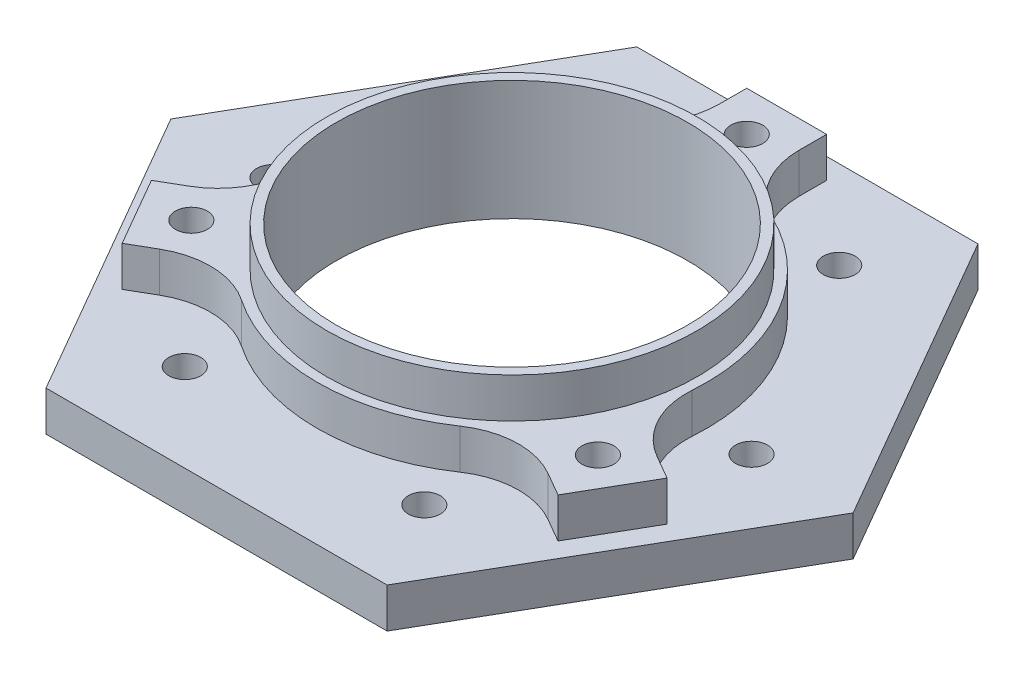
ISO-10303-21;
HEADER;
FILE_DESCRIPTION(('STEP AP214'),'2;1');
FILE_NAME('part.step','',(''),(''),'','','');
FILE_SCHEMA(('AUTOMOTIVE_DESIGN { 1 0 10303 214 1 1 1 1 }'));
ENDSEC;
DATA;
#1=APPLICATION_CONTEXT('core data for automotive mechanical design processes');
#2=APPLICATION_PROTOCOL_DEFINITION('international standard','automotive_design',2000,#1);
#3=PRODUCT_CONTEXT('',#1,'mechanical');
#4=PRODUCT('Part','Part','',(#3));
#5=PRODUCT_RELATED_PRODUCT_CATEGORY('part','',(#4));
#6=PRODUCT_DEFINITION_FORMATION('','',#4);
#7=PRODUCT_DEFINITION_CONTEXT('part definition',#1,'design');
#8=PRODUCT_DEFINITION('design','',#6,#7);
#9=PRODUCT_DEFINITION_SHAPE('','',#8);
#10=(LENGTH_UNIT() NAMED_UNIT(*) SI_UNIT(.MILLI.,.METRE.));
#11=(NAMED_UNIT(*) PLANE_ANGLE_UNIT() SI_UNIT($,.RADIAN.));
#12=(NAMED_UNIT(*) SI_UNIT($,.STERADIAN.) SOLID_ANGLE_UNIT());
#13=UNCERTAINTY_MEASURE_WITH_UNIT(LENGTH_MEASURE(1.E-05),#10,'distance_accuracy_value','');
#14=(GEOMETRIC_REPRESENTATION_CONTEXT(3) GLOBAL_UNCERTAINTY_ASSIGNED_CONTEXT((#13)) GLOBAL_UNIT_ASSIGNED_CONTEXT((#10,
#11,#12)) REPRESENTATION_CONTEXT('',''));
#15=CARTESIAN_POINT('',(0.,0.,0.));
#16=DIRECTION('',(0.,0.,1.));
#17=DIRECTION('',(1.,0.,0.));
#18=AXIS2_PLACEMENT_3D('',#15,#16,#17);
#19=CARTESIAN_POINT('',(0.,10.,0.));
#20=DIRECTION('',(0.,-1.,0.));
#21=DIRECTION('',(0.,0.,-1.));
#22=AXIS2_PLACEMENT_3D('',#19,#20,#21);
#23=CYLINDRICAL_SURFACE('',#22,24.4);
#24=CARTESIAN_POINT('',(0.,10.,0.));
#25=DIRECTION('',(0.,1.,0.));
#26=DIRECTION('',(0.,0.,1.));
#27=AXIS2_PLACEMENT_3D('',#24,#25,#26);
#28=CIRCLE('',#27,24.4);
#29=CARTESIAN_POINT('',(-13.6965472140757,10.,20.1931818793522));
#30=VERTEX_POINT('',#29);
#31=CARTESIAN_POINT('',(13.6965472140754,10.,20.1931818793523));
#32=VERTEX_POINT('',#31);
#33=EDGE_CURVE('E311',#30,#32,#28,.T.);
#34=ORIENTED_EDGE('',*,*,#33,.F.);
#35=DIRECTION('',(0.,-1.,0.));
#36=VECTOR('',#35,1.);
#37=CARTESIAN_POINT('',(-13.6965472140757,10.,20.1931818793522));
#38=LINE('',#37,#36);
#39=CARTESIAN_POINT('',(-13.6965472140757,5.,20.1931818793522));
#40=VERTEX_POINT('',#39);
#41=EDGE_CURVE('E410',#30,#40,#38,.T.);
#42=ORIENTED_EDGE('',*,*,#41,.T.);
#43=CARTESIAN_POINT('',(0.,5.,0.));
#44=DIRECTION('',(0.,1.,0.));
#45=DIRECTION('',(0.,0.,1.));
#46=AXIS2_PLACEMENT_3D('',#43,#44,#45);
#47=CIRCLE('',#46,24.4);
#48=CARTESIAN_POINT('',(13.6965472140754,5.,20.1931818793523));
#49=VERTEX_POINT('',#48);
#50=EDGE_CURVE('E315',#40,#49,#47,.T.);
#51=ORIENTED_EDGE('',*,*,#50,.T.);
#52=DIRECTION('',(0.,-1.,0.));
#53=VECTOR('',#52,1.);
#54=CARTESIAN_POINT('',(13.6965472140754,10.,20.1931818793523));
#55=LINE('',#54,#53);
#56=EDGE_CURVE('E408',#49,#32,#55,.F.);
#57=ORIENTED_EDGE('',*,*,#56,.T.);
#58=EDGE_LOOP('',(#34,#42,#51,#57));
#59=FACE_BOUND('',#58,.T.);
#60=ADVANCED_FACE('F53',(#59),#23,.T.);
#61=CARTESIAN_POINT('',(-10.6395348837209,5.,-21.9581487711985));
#62=VERTEX_POINT('',#61);
#63=CARTESIAN_POINT('',(-24.3360820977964,5.,1.76496689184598));
#64=VERTEX_POINT('',#63);
#65=EDGE_CURVE('E316',#62,#64,#47,.T.);
#66=ORIENTED_EDGE('',*,*,#65,.T.);
#67=DIRECTION('',(0.,-1.,0.));
#68=VECTOR('',#67,1.);
#69=CARTESIAN_POINT('',(-24.3360820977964,10.,1.76496689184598));
#70=LINE('',#69,#68);
#71=CARTESIAN_POINT('',(-24.3360820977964,10.,1.76496689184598));
#72=VERTEX_POINT('',#71);
#73=EDGE_CURVE('E76',#64,#72,#70,.F.);
#74=ORIENTED_EDGE('',*,*,#73,.T.);
#75=CARTESIAN_POINT('',(-10.6395348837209,10.,-21.9581487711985));
#76=VERTEX_POINT('',#75);
#77=EDGE_CURVE('E308',#76,#72,#28,.T.);
#78=ORIENTED_EDGE('',*,*,#77,.F.);
#79=DIRECTION('',(0.,-1.,0.));
#80=VECTOR('',#79,1.);
#81=CARTESIAN_POINT('',(-10.6395348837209,10.,-21.9581487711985));
#82=LINE('',#81,#80);
#83=EDGE_CURVE('E441',#76,#62,#82,.T.);
#84=ORIENTED_EDGE('',*,*,#83,.T.);
#85=EDGE_LOOP('',(#66,#74,#78,#84));
#86=FACE_BOUND('',#85,.T.);
#87=ADVANCED_FACE('F460',(#86),#23,.T.);
#88=CARTESIAN_POINT('',(24.3360820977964,10.,1.76496689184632));
#89=VERTEX_POINT('',#88);
#90=CARTESIAN_POINT('',(10.6395348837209,10.,-21.9581487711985));
#91=VERTEX_POINT('',#90);
#92=EDGE_CURVE('E312',#89,#91,#28,.T.);
#93=ORIENTED_EDGE('',*,*,#92,.F.);
#94=DIRECTION('',(0.,-1.,0.));
#95=VECTOR('',#94,1.);
#96=CARTESIAN_POINT('',(24.3360820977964,10.,1.76496689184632));
#97=LINE('',#96,#95);
#98=CARTESIAN_POINT('',(24.3360820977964,5.,1.76496689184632));
#99=VERTEX_POINT('',#98);
#100=EDGE_CURVE('E432',#89,#99,#97,.T.);
#101=ORIENTED_EDGE('',*,*,#100,.T.);
#102=CARTESIAN_POINT('',(10.6395348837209,5.,-21.9581487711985));
#103=VERTEX_POINT('',#102);
#104=EDGE_CURVE('E305',#99,#103,#47,.T.);
#105=ORIENTED_EDGE('',*,*,#104,.T.);
#106=DIRECTION('',(0.,-1.,0.));
#107=VECTOR('',#106,1.);
#108=CARTESIAN_POINT('',(10.6395348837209,10.,-21.9581487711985));
#109=LINE('',#108,#107);
#110=EDGE_CURVE('E430',#103,#91,#109,.F.);
#111=ORIENTED_EDGE('',*,*,#110,.T.);
#112=EDGE_LOOP('',(#93,#101,#105,#111));
#113=FACE_BOUND('',#112,.T.);
#114=ADVANCED_FACE('F495',(#113),#23,.T.);
#115=CARTESIAN_POINT('',(0.,10.,0.));
#116=DIRECTION('',(0.,1.,0.));
#117=DIRECTION('',(0.,0.,1.));
#118=AXIS2_PLACEMENT_3D('',#115,#116,#117);
#119=PLANE('',#118);
#120=DIRECTION('',(0.,0.,1.));
#121=VECTOR('',#120,1.);
#122=CARTESIAN_POINT('',(-5.,10.,-34.4));
#123=LINE('',#122,#121);
#124=CARTESIAN_POINT('',(-5.,10.,-34.4));
#125=VERTEX_POINT('',#124);
#126=CARTESIAN_POINT('',(-5.,10.,-30.95739007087));
#127=VERTEX_POINT('',#126);
#128=EDGE_CURVE('E277',#125,#127,#123,.T.);
#129=ORIENTED_EDGE('',*,*,#128,.T.);
#130=CARTESIAN_POINT('',(-15.,10.,-30.95739007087));
#131=DIRECTION('',(0.,1.,0.));
#132=DIRECTION('',(0.,0.,1.));
#133=AXIS2_PLACEMENT_3D('',#130,#131,#132);
#134=CIRCLE('',#133,10.);
#135=EDGE_CURVE('E12',#127,#76,#134,.F.);
#136=ORIENTED_EDGE('',*,*,#135,.T.);
#137=ORIENTED_EDGE('',*,*,#77,.T.);
#138=CARTESIAN_POINT('',(-34.3098862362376,10.,2.4883139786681));
#139=DIRECTION('',(0.,1.,0.));
#140=DIRECTION('',(0.,0.,1.));
#141=AXIS2_PLACEMENT_3D('',#138,#139,#140);
#142=CIRCLE('',#141,10.);
#143=CARTESIAN_POINT('',(-29.3098862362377,10.,11.1485680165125));
#144=VERTEX_POINT('',#143);
#145=EDGE_CURVE('E61',#72,#144,#142,.F.);
#146=ORIENTED_EDGE('',*,*,#145,.T.);
#147=DIRECTION('',(-0.866025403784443,0.,0.499999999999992));
#148=VECTOR('',#147,1.);
#149=CARTESIAN_POINT('',(-32.2912738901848,10.,12.8698729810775));
#150=LINE('',#149,#148);
#151=CARTESIAN_POINT('',(-32.2912738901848,10.,12.8698729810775));
#152=VERTEX_POINT('',#151);
#153=EDGE_CURVE('E228',#144,#152,#150,.T.);
#154=ORIENTED_EDGE('',*,*,#153,.T.);
#155=DIRECTION('',(0.499999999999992,0.,0.866025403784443));
#156=VECTOR('',#155,1.);
#157=CARTESIAN_POINT('',(-27.2912738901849,10.,21.5301270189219));
#158=LINE('',#157,#156);
#159=CARTESIAN_POINT('',(-27.2912738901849,10.,21.5301270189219));
#160=VERTEX_POINT('',#159);
#161=EDGE_CURVE('E236',#152,#160,#158,.T.);
#162=ORIENTED_EDGE('',*,*,#161,.T.);
#163=DIRECTION('',(0.866025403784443,0.,-0.499999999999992));
#164=VECTOR('',#163,1.);
#165=CARTESIAN_POINT('',(-27.2912738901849,10.,21.5301270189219));
#166=LINE('',#165,#164);
#167=CARTESIAN_POINT('',(-24.3098862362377,10.,19.808822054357));
#168=VERTEX_POINT('',#167);
#169=EDGE_CURVE('E252',#160,#168,#166,.T.);
#170=ORIENTED_EDGE('',*,*,#169,.T.);
#171=CARTESIAN_POINT('',(-19.3098862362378,10.,28.4690760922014));
#172=DIRECTION('',(0.,1.,0.));
#173=DIRECTION('',(0.,0.,1.));
#174=AXIS2_PLACEMENT_3D('',#171,#172,#173);
#175=CIRCLE('',#174,10.);
#176=EDGE_CURVE('E446',#168,#30,#175,.F.);
#177=ORIENTED_EDGE('',*,*,#176,.T.);
#178=ORIENTED_EDGE('',*,*,#33,.T.);
#179=CARTESIAN_POINT('',(19.3098862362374,10.,28.4690760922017));
#180=DIRECTION('',(0.,1.,0.));
#181=DIRECTION('',(0.,0.,1.));
#182=AXIS2_PLACEMENT_3D('',#179,#180,#181);
#183=CIRCLE('',#182,10.);
#184=CARTESIAN_POINT('',(24.3098862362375,10.,19.8088220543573));
#185=VERTEX_POINT('',#184);
#186=EDGE_CURVE('E448',#32,#185,#183,.F.);
#187=ORIENTED_EDGE('',*,*,#186,.T.);
#188=DIRECTION('',(0.866025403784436,0.,0.500000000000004));
#189=VECTOR('',#188,1.);
#190=CARTESIAN_POINT('',(27.2912738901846,10.,21.5301270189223));
#191=LINE('',#190,#189);
#192=CARTESIAN_POINT('',(27.2912738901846,10.,21.5301270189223));
#193=VERTEX_POINT('',#192);
#194=EDGE_CURVE('E259',#185,#193,#191,.T.);
#195=ORIENTED_EDGE('',*,*,#194,.T.);
#196=DIRECTION('',(0.500000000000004,0.,-0.866025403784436));
#197=VECTOR('',#196,1.);
#198=CARTESIAN_POINT('',(32.2912738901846,10.,12.869872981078));
#199=LINE('',#198,#197);
#200=CARTESIAN_POINT('',(32.2912738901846,10.,12.869872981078));
#201=VERTEX_POINT('',#200);
#202=EDGE_CURVE('E256',#193,#201,#199,.T.);
#203=ORIENTED_EDGE('',*,*,#202,.T.);
#204=DIRECTION('',(-0.866025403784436,0.,-0.500000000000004));
#205=VECTOR('',#204,1.);
#206=CARTESIAN_POINT('',(32.2912738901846,10.,12.869872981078));
#207=LINE('',#206,#205);
#208=CARTESIAN_POINT('',(29.3098862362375,10.,11.1485680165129));
#209=VERTEX_POINT('',#208);
#210=EDGE_CURVE('E253',#201,#209,#207,.T.);
#211=ORIENTED_EDGE('',*,*,#210,.T.);
#212=CARTESIAN_POINT('',(34.3098862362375,10.,2.48831397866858));
#213=DIRECTION('',(0.,1.,0.));
#214=DIRECTION('',(0.,0.,1.));
#215=AXIS2_PLACEMENT_3D('',#212,#213,#214);
#216=CIRCLE('',#215,10.);
#217=EDGE_CURVE('E450',#209,#89,#216,.F.);
#218=ORIENTED_EDGE('',*,*,#217,.T.);
#219=ORIENTED_EDGE('',*,*,#92,.T.);
#220=CARTESIAN_POINT('',(15.,10.,-30.95739007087));
#221=DIRECTION('',(0.,1.,0.));
#222=DIRECTION('',(0.,0.,1.));
#223=AXIS2_PLACEMENT_3D('',#220,#221,#222);
#224=CIRCLE('',#223,10.);
#225=CARTESIAN_POINT('',(5.,10.,-30.95739007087));
#226=VERTEX_POINT('',#225);
#227=EDGE_CURVE('E452',#91,#226,#224,.F.);
#228=ORIENTED_EDGE('',*,*,#227,.T.);
#229=DIRECTION('',(0.,0.,-1.));
#230=VECTOR('',#229,1.);
#231=CARTESIAN_POINT('',(5.,10.,-34.4));
#232=LINE('',#231,#230);
#233=CARTESIAN_POINT('',(5.,10.,-34.4));
#234=VERTEX_POINT('',#233);
#235=EDGE_CURVE('E282',#226,#234,#232,.T.);
#236=ORIENTED_EDGE('',*,*,#235,.T.);
#237=DIRECTION('',(-1.,0.,0.));
#238=VECTOR('',#237,1.);
#239=CARTESIAN_POINT('',(-5.,10.,-34.4));
#240=LINE('',#239,#238);
#241=EDGE_CURVE('E279',#234,#125,#240,.T.);
#242=ORIENTED_EDGE('',*,*,#241,.T.);
#243=EDGE_LOOP('',(#129,#136,#137,#146,#154,#162,#170,#177,#178,#187,#195,#203,#211,#218,#219,
#228,#236,#242));
#244=FACE_BOUND('',#243,.T.);
#245=CARTESIAN_POINT('',(0.,10.,0.));
#246=DIRECTION('',(0.,1.,0.));
#247=DIRECTION('',(0.,0.,1.));
#248=AXIS2_PLACEMENT_3D('',#245,#246,#247);
#249=CIRCLE('',#248,23.2);
#250=CARTESIAN_POINT('',(0.,10.,23.2));
#251=VERTEX_POINT('',#250);
#252=EDGE_CURVE('E301',#251,#251,#249,.T.);
#253=ORIENTED_EDGE('',*,*,#252,.F.);
#254=EDGE_LOOP('',(#253));
#255=FACE_BOUND('',#254,.T.);
#256=CARTESIAN_POINT('',(0.,10.,-29.4));
#257=DIRECTION('',(0.,1.,0.));
#258=DIRECTION('',(0.,0.,1.));
#259=AXIS2_PLACEMENT_3D('',#256,#257,#258);
#260=CIRCLE('',#259,2.);
#261=CARTESIAN_POINT('',(0.,10.,-27.4));
#262=VERTEX_POINT('',#261);
#263=EDGE_CURVE('E274',#262,#262,#260,.T.);
#264=ORIENTED_EDGE('',*,*,#263,.F.);
#265=EDGE_LOOP('',(#264));
#266=FACE_BOUND('',#265,.T.);
#267=CARTESIAN_POINT('',(25.4611468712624,10.,14.7000000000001));
#268=DIRECTION('',(0.,1.,0.));
#269=DIRECTION('',(0.,0.,1.));
#270=AXIS2_PLACEMENT_3D('',#267,#268,#269);
#271=CIRCLE('',#270,2.);
#272=CARTESIAN_POINT('',(25.4611468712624,10.,16.7000000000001));
#273=VERTEX_POINT('',#272);
#274=EDGE_CURVE('E237',#273,#273,#271,.T.);
#275=ORIENTED_EDGE('',*,*,#274,.F.);
#276=EDGE_LOOP('',(#275));
#277=FACE_BOUND('',#276,.T.);
#278=CARTESIAN_POINT('',(-25.4611468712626,10.,14.6999999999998));
#279=DIRECTION('',(0.,1.,0.));
#280=DIRECTION('',(0.,0.,1.));
#281=AXIS2_PLACEMENT_3D('',#278,#279,#280);
#282=CIRCLE('',#281,2.);
#283=CARTESIAN_POINT('',(-25.4611468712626,10.,16.6999999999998));
#284=VERTEX_POINT('',#283);
#285=EDGE_CURVE('E249',#284,#284,#282,.T.);
#286=ORIENTED_EDGE('',*,*,#285,.F.);
#287=EDGE_LOOP('',(#286));
#288=FACE_BOUND('',#287,.T.);
#289=ADVANCED_FACE('F455',(#244,#255,#266,#277,#288),#119,.T.);
#290=CARTESIAN_POINT('',(0.,5.,0.));
#291=DIRECTION('',(0.,1.,0.));
#292=DIRECTION('',(0.,0.,1.));
#293=AXIS2_PLACEMENT_3D('',#290,#291,#292);
#294=PLANE('',#293);
#295=CARTESIAN_POINT('',(-15.,5.,-25.9807621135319));
#296=DIRECTION('',(0.,1.,0.));
#297=DIRECTION('',(0.,0.,1.));
#298=AXIS2_PLACEMENT_3D('',#295,#296,#297);
#299=CIRCLE('',#298,2.00000000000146);
#300=CARTESIAN_POINT('',(-15.,5.,-23.9807621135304));
#301=VERTEX_POINT('',#300);
#302=EDGE_CURVE('E317',#301,#301,#299,.T.);
#303=ORIENTED_EDGE('',*,*,#302,.F.);
#304=EDGE_LOOP('',(#303));
#305=FACE_BOUND('',#304,.T.);
#306=CARTESIAN_POINT('',(-14.9999999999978,5.,25.9807621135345));
#307=DIRECTION('',(0.,1.,0.));
#308=DIRECTION('',(0.,0.,1.));
#309=AXIS2_PLACEMENT_3D('',#306,#307,#308);
#310=CIRCLE('',#309,2.00000000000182);
#311=CARTESIAN_POINT('',(-14.9999999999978,5.,27.9807621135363));
#312=VERTEX_POINT('',#311);
#313=EDGE_CURVE('E329',#312,#312,#310,.T.);
#314=ORIENTED_EDGE('',*,*,#313,.F.);
#315=EDGE_LOOP('',(#314));
#316=FACE_BOUND('',#315,.T.);
#317=CARTESIAN_POINT('',(30.0000000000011,5.,-6.41768405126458E-13));
#318=DIRECTION('',(0.,1.,0.));
#319=DIRECTION('',(0.,0.,1.));
#320=AXIS2_PLACEMENT_3D('',#317,#318,#319);
#321=CIRCLE('',#320,1.99999999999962);
#322=CARTESIAN_POINT('',(30.0000000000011,5.,1.99999999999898));
#323=VERTEX_POINT('',#322);
#324=EDGE_CURVE('E341',#323,#323,#321,.T.);
#325=ORIENTED_EDGE('',*,*,#324,.F.);
#326=EDGE_LOOP('',(#325));
#327=FACE_BOUND('',#326,.T.);
#328=DIRECTION('',(0.499999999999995,0.,-0.866025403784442));
#329=VECTOR('',#328,1.);
#330=CARTESIAN_POINT('',(21.3619599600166,5.,36.9999999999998));
#331=LINE('',#330,#329);
#332=CARTESIAN_POINT('',(21.3619599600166,5.,36.9999999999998));
#333=VERTEX_POINT('',#332);
#334=CARTESIAN_POINT('',(42.7239199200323,5.,0.));
#335=VERTEX_POINT('',#334);
#336=EDGE_CURVE('E356',#333,#335,#331,.T.);
#337=ORIENTED_EDGE('',*,*,#336,.T.);
#338=DIRECTION('',(-0.500000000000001,0.,-0.866025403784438));
#339=VECTOR('',#338,1.);
#340=CARTESIAN_POINT('',(42.7239199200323,5.,0.));
#341=LINE('',#340,#339);
#342=CARTESIAN_POINT('',(21.3619599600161,5.,-37.0000000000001));
#343=VERTEX_POINT('',#342);
#344=EDGE_CURVE('E359',#335,#343,#341,.T.);
#345=ORIENTED_EDGE('',*,*,#344,.T.);
#346=DIRECTION('',(-1.,0.,0.));
#347=VECTOR('',#346,1.);
#348=CARTESIAN_POINT('',(21.3619599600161,5.,-37.0000000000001));
#349=LINE('',#348,#347);
#350=CARTESIAN_POINT('',(-21.3619599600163,5.,-36.9999999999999));
#351=VERTEX_POINT('',#350);
#352=EDGE_CURVE('E362',#343,#351,#349,.T.);
#353=ORIENTED_EDGE('',*,*,#352,.T.);
#354=DIRECTION('',(-0.499999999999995,0.,0.866025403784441));
#355=VECTOR('',#354,1.);
#356=CARTESIAN_POINT('',(-21.3619599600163,5.,-36.9999999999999));
#357=LINE('',#356,#355);
#358=CARTESIAN_POINT('',(-42.7239199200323,5.,2.98339538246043E-13));
#359=VERTEX_POINT('',#358);
#360=EDGE_CURVE('E364',#351,#359,#357,.T.);
#361=ORIENTED_EDGE('',*,*,#360,.T.);
#362=DIRECTION('',(0.500000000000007,0.,0.866025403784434));
#363=VECTOR('',#362,1.);
#364=CARTESIAN_POINT('',(-42.7239199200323,5.,2.98339538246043E-13));
#365=LINE('',#364,#363);
#366=CARTESIAN_POINT('',(-21.3619599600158,5.,37.0000000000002));
#367=VERTEX_POINT('',#366);
#368=EDGE_CURVE('E366',#359,#367,#365,.T.);
#369=ORIENTED_EDGE('',*,*,#368,.T.);
#370=DIRECTION('',(1.,0.,0.));
#371=VECTOR('',#370,1.);
#372=CARTESIAN_POINT('',(-21.3619599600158,5.,37.0000000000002));
#373=LINE('',#372,#371);
#374=EDGE_CURVE('E368',#367,#333,#373,.T.);
#375=ORIENTED_EDGE('',*,*,#374,.T.);
#376=EDGE_LOOP('',(#337,#345,#353,#361,#369,#375));
#377=FACE_BOUND('',#376,.T.);
#378=CARTESIAN_POINT('',(14.9999999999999,5.,-25.9807621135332));
#379=DIRECTION('',(0.,1.,0.));
#380=DIRECTION('',(0.,0.,1.));
#381=AXIS2_PLACEMENT_3D('',#378,#379,#380);
#382=CIRCLE('',#381,2.);
#383=CARTESIAN_POINT('',(14.9999999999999,5.,-23.9807621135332));
#384=VERTEX_POINT('',#383);
#385=EDGE_CURVE('E347',#384,#384,#382,.T.);
#386=ORIENTED_EDGE('',*,*,#385,.F.);
#387=EDGE_LOOP('',(#386));
#388=FACE_BOUND('',#387,.T.);
#389=CARTESIAN_POINT('',(15.0000000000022,5.,25.9807621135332));
#390=DIRECTION('',(0.,1.,0.));
#391=DIRECTION('',(0.,0.,1.));
#392=AXIS2_PLACEMENT_3D('',#389,#390,#391);
#393=CIRCLE('',#392,2.00000000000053);
#394=CARTESIAN_POINT('',(15.0000000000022,5.,27.9807621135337));
#395=VERTEX_POINT('',#394);
#396=EDGE_CURVE('E335',#395,#395,#393,.T.);
#397=ORIENTED_EDGE('',*,*,#396,.F.);
#398=EDGE_LOOP('',(#397));
#399=FACE_BOUND('',#398,.T.);
#400=CARTESIAN_POINT('',(-29.9999999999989,5.,1.95363531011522E-12));
#401=DIRECTION('',(0.,1.,0.));
#402=DIRECTION('',(0.,0.,1.));
#403=AXIS2_PLACEMENT_3D('',#400,#401,#402);
#404=CIRCLE('',#403,2.00000000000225);
#405=CARTESIAN_POINT('',(-29.9999999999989,5.,2.00000000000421));
#406=VERTEX_POINT('',#405);
#407=EDGE_CURVE('E323',#406,#406,#404,.T.);
#408=ORIENTED_EDGE('',*,*,#407,.F.);
#409=EDGE_LOOP('',(#408));
#410=FACE_BOUND('',#409,.T.);
#411=ORIENTED_EDGE('',*,*,#50,.F.);
#412=CARTESIAN_POINT('',(-19.3098862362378,5.,28.4690760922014));
#413=DIRECTION('',(0.,1.,0.));
#414=DIRECTION('',(0.,0.,1.));
#415=AXIS2_PLACEMENT_3D('',#412,#413,#414);
#416=CIRCLE('',#415,10.);
#417=CARTESIAN_POINT('',(-24.3098862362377,5.,19.808822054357));
#418=VERTEX_POINT('',#417);
#419=EDGE_CURVE('E423',#40,#418,#416,.T.);
#420=ORIENTED_EDGE('',*,*,#419,.T.);
#421=DIRECTION('',(0.866025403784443,0.,-0.499999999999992));
#422=VECTOR('',#421,1.);
#423=CARTESIAN_POINT('',(-27.2912738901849,5.,21.5301270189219));
#424=LINE('',#423,#422);
#425=CARTESIAN_POINT('',(-27.2912738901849,5.,21.5301270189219));
#426=VERTEX_POINT('',#425);
#427=EDGE_CURVE('E243',#426,#418,#424,.T.);
#428=ORIENTED_EDGE('',*,*,#427,.F.);
#429=DIRECTION('',(0.499999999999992,0.,0.866025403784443));
#430=VECTOR('',#429,1.);
#431=CARTESIAN_POINT('',(-27.2912738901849,5.,21.5301270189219));
#432=LINE('',#431,#430);
#433=CARTESIAN_POINT('',(-32.2912738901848,5.,12.8698729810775));
#434=VERTEX_POINT('',#433);
#435=EDGE_CURVE('E227',#434,#426,#432,.T.);
#436=ORIENTED_EDGE('',*,*,#435,.F.);
#437=DIRECTION('',(-0.866025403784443,0.,0.499999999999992));
#438=VECTOR('',#437,1.);
#439=CARTESIAN_POINT('',(-32.2912738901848,5.,12.8698729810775));
#440=LINE('',#439,#438);
#441=CARTESIAN_POINT('',(-29.3098862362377,5.,11.1485680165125));
#442=VERTEX_POINT('',#441);
#443=EDGE_CURVE('E218',#442,#434,#440,.T.);
#444=ORIENTED_EDGE('',*,*,#443,.F.);
#445=CARTESIAN_POINT('',(-34.3098862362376,5.,2.4883139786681));
#446=DIRECTION('',(0.,1.,0.));
#447=DIRECTION('',(0.,0.,1.));
#448=AXIS2_PLACEMENT_3D('',#445,#446,#447);
#449=CIRCLE('',#448,10.);
#450=EDGE_CURVE('E415',#442,#64,#449,.T.);
#451=ORIENTED_EDGE('',*,*,#450,.T.);
#452=ORIENTED_EDGE('',*,*,#65,.F.);
#453=CARTESIAN_POINT('',(-15.,5.,-30.95739007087));
#454=DIRECTION('',(0.,1.,0.));
#455=DIRECTION('',(0.,0.,1.));
#456=AXIS2_PLACEMENT_3D('',#453,#454,#455);
#457=CIRCLE('',#456,10.);
#458=CARTESIAN_POINT('',(-5.,5.,-30.95739007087));
#459=VERTEX_POINT('',#458);
#460=EDGE_CURVE('E413',#62,#459,#457,.T.);
#461=ORIENTED_EDGE('',*,*,#460,.T.);
#462=DIRECTION('',(0.,0.,1.));
#463=VECTOR('',#462,1.);
#464=CARTESIAN_POINT('',(-5.,5.,-34.4));
#465=LINE('',#464,#463);
#466=CARTESIAN_POINT('',(-5.,5.,-34.4));
#467=VERTEX_POINT('',#466);
#468=EDGE_CURVE('E289',#467,#459,#465,.T.);
#469=ORIENTED_EDGE('',*,*,#468,.F.);
#470=DIRECTION('',(-1.,0.,0.));
#471=VECTOR('',#470,1.);
#472=CARTESIAN_POINT('',(-5.,5.,-34.4));
#473=LINE('',#472,#471);
#474=CARTESIAN_POINT('',(5.,5.,-34.4));
#475=VERTEX_POINT('',#474);
#476=EDGE_CURVE('E286',#475,#467,#473,.T.);
#477=ORIENTED_EDGE('',*,*,#476,.F.);
#478=DIRECTION('',(0.,0.,-1.));
#479=VECTOR('',#478,1.);
#480=CARTESIAN_POINT('',(5.,5.,-34.4));
#481=LINE('',#480,#479);
#482=CARTESIAN_POINT('',(5.,5.,-30.95739007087));
#483=VERTEX_POINT('',#482);
#484=EDGE_CURVE('E284',#483,#475,#481,.T.);
#485=ORIENTED_EDGE('',*,*,#484,.F.);
#486=CARTESIAN_POINT('',(15.,5.,-30.95739007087));
#487=DIRECTION('',(0.,1.,0.));
#488=DIRECTION('',(0.,0.,1.));
#489=AXIS2_PLACEMENT_3D('',#486,#487,#488);
#490=CIRCLE('',#489,10.);
#491=EDGE_CURVE('E417',#483,#103,#490,.T.);
#492=ORIENTED_EDGE('',*,*,#491,.T.);
#493=ORIENTED_EDGE('',*,*,#104,.F.);
#494=CARTESIAN_POINT('',(34.3098862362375,5.,2.48831397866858));
#495=DIRECTION('',(0.,1.,0.));
#496=DIRECTION('',(0.,0.,1.));
#497=AXIS2_PLACEMENT_3D('',#494,#495,#496);
#498=CIRCLE('',#497,10.);
#499=CARTESIAN_POINT('',(29.3098862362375,5.,11.1485680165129));
#500=VERTEX_POINT('',#499);
#501=EDGE_CURVE('E419',#99,#500,#498,.T.);
#502=ORIENTED_EDGE('',*,*,#501,.T.);
#503=DIRECTION('',(-0.866025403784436,0.,-0.500000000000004));
#504=VECTOR('',#503,1.);
#505=CARTESIAN_POINT('',(32.2912738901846,5.,12.869872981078));
#506=LINE('',#505,#504);
#507=CARTESIAN_POINT('',(32.2912738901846,5.,12.869872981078));
#508=VERTEX_POINT('',#507);
#509=EDGE_CURVE('E266',#508,#500,#506,.T.);
#510=ORIENTED_EDGE('',*,*,#509,.F.);
#511=DIRECTION('',(0.500000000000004,0.,-0.866025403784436));
#512=VECTOR('',#511,1.);
#513=CARTESIAN_POINT('',(32.2912738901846,5.,12.869872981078));
#514=LINE('',#513,#512);
#515=CARTESIAN_POINT('',(27.2912738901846,5.,21.5301270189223));
#516=VERTEX_POINT('',#515);
#517=EDGE_CURVE('E263',#516,#508,#514,.T.);
#518=ORIENTED_EDGE('',*,*,#517,.F.);
#519=DIRECTION('',(0.866025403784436,0.,0.500000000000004));
#520=VECTOR('',#519,1.);
#521=CARTESIAN_POINT('',(27.2912738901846,5.,21.5301270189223));
#522=LINE('',#521,#520);
#523=CARTESIAN_POINT('',(24.3098862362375,5.,19.8088220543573));
#524=VERTEX_POINT('',#523);
#525=EDGE_CURVE('E261',#524,#516,#522,.T.);
#526=ORIENTED_EDGE('',*,*,#525,.F.);
#527=CARTESIAN_POINT('',(19.3098862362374,5.,28.4690760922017));
#528=DIRECTION('',(0.,1.,0.));
#529=DIRECTION('',(0.,0.,1.));
#530=AXIS2_PLACEMENT_3D('',#527,#528,#529);
#531=CIRCLE('',#530,10.);
#532=EDGE_CURVE('E421',#524,#49,#531,.T.);
#533=ORIENTED_EDGE('',*,*,#532,.T.);
#534=EDGE_LOOP('',(#411,#420,#428,#436,#444,#451,#452,#461,#469,#477,#485,#492,#493,#502,#510,
#518,#526,#533));
#535=FACE_BOUND('',#534,.T.);
#536=ADVANCED_FACE('F241',(#305,#316,#327,#377,#388,#399,#410,#535),#294,.T.);
#537=CARTESIAN_POINT('',(0.,0.,0.));
#538=DIRECTION('',(0.,1.,0.));
#539=DIRECTION('',(0.,0.,1.));
#540=AXIS2_PLACEMENT_3D('',#537,#538,#539);
#541=PLANE('',#540);
#542=DIRECTION('',(0.499999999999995,0.,-0.866025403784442));
#543=VECTOR('',#542,1.);
#544=CARTESIAN_POINT('',(21.3619599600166,0.,36.9999999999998));
#545=LINE('',#544,#543);
#546=CARTESIAN_POINT('',(21.3619599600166,0.,36.9999999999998));
#547=VERTEX_POINT('',#546);
#548=CARTESIAN_POINT('',(42.7239199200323,0.,0.));
#549=VERTEX_POINT('',#548);
#550=EDGE_CURVE('E355',#547,#549,#545,.T.);
#551=ORIENTED_EDGE('',*,*,#550,.F.);
#552=DIRECTION('',(1.,0.,0.));
#553=VECTOR('',#552,1.);
#554=CARTESIAN_POINT('',(-21.3619599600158,0.,37.0000000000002));
#555=LINE('',#554,#553);
#556=CARTESIAN_POINT('',(-21.3619599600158,0.,37.0000000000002));
#557=VERTEX_POINT('',#556);
#558=EDGE_CURVE('E360',#557,#547,#555,.T.);
#559=ORIENTED_EDGE('',*,*,#558,.F.);
#560=DIRECTION('',(0.500000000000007,0.,0.866025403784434));
#561=VECTOR('',#560,1.);
#562=CARTESIAN_POINT('',(-42.7239199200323,0.,2.98339538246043E-13));
#563=LINE('',#562,#561);
#564=CARTESIAN_POINT('',(-42.7239199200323,0.,2.98339538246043E-13));
#565=VERTEX_POINT('',#564);
#566=EDGE_CURVE('E379',#565,#557,#563,.T.);
#567=ORIENTED_EDGE('',*,*,#566,.F.);
#568=DIRECTION('',(-0.499999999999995,0.,0.866025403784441));
#569=VECTOR('',#568,1.);
#570=CARTESIAN_POINT('',(-21.3619599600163,0.,-36.9999999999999));
#571=LINE('',#570,#569);
#572=CARTESIAN_POINT('',(-21.3619599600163,0.,-36.9999999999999));
#573=VERTEX_POINT('',#572);
#574=EDGE_CURVE('E377',#573,#565,#571,.T.);
#575=ORIENTED_EDGE('',*,*,#574,.F.);
#576=DIRECTION('',(-1.,0.,0.));
#577=VECTOR('',#576,1.);
#578=CARTESIAN_POINT('',(21.3619599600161,0.,-37.0000000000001));
#579=LINE('',#578,#577);
#580=CARTESIAN_POINT('',(21.3619599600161,0.,-37.0000000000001));
#581=VERTEX_POINT('',#580);
#582=EDGE_CURVE('E375',#581,#573,#579,.T.);
#583=ORIENTED_EDGE('',*,*,#582,.F.);
#584=DIRECTION('',(-0.500000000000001,0.,-0.866025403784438));
#585=VECTOR('',#584,1.);
#586=CARTESIAN_POINT('',(42.7239199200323,0.,0.));
#587=LINE('',#586,#585);
#588=EDGE_CURVE('E373',#549,#581,#587,.T.);
#589=ORIENTED_EDGE('',*,*,#588,.F.);
#590=EDGE_LOOP('',(#551,#559,#567,#575,#583,#589));
#591=FACE_BOUND('',#590,.T.);
#592=CARTESIAN_POINT('',(0.,0.,0.));
#593=DIRECTION('',(0.,1.,0.));
#594=DIRECTION('',(0.,0.,1.));
#595=AXIS2_PLACEMENT_3D('',#592,#593,#594);
#596=CIRCLE('',#595,22.);
#597=CARTESIAN_POINT('',(0.,0.,22.));
#598=VERTEX_POINT('',#597);
#599=EDGE_CURVE('E350',#598,#598,#596,.T.);
#600=ORIENTED_EDGE('',*,*,#599,.T.);
#601=EDGE_LOOP('',(#600));
#602=FACE_BOUND('',#601,.T.);
#603=CARTESIAN_POINT('',(14.9999999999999,0.,-25.9807621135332));
#604=DIRECTION('',(0.,1.,0.));
#605=DIRECTION('',(0.,0.,1.));
#606=AXIS2_PLACEMENT_3D('',#603,#604,#605);
#607=CIRCLE('',#606,2.);
#608=CARTESIAN_POINT('',(14.9999999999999,0.,-23.9807621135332));
#609=VERTEX_POINT('',#608);
#610=EDGE_CURVE('E344',#609,#609,#607,.T.);
#611=ORIENTED_EDGE('',*,*,#610,.T.);
#612=EDGE_LOOP('',(#611));
#613=FACE_BOUND('',#612,.T.);
#614=CARTESIAN_POINT('',(30.0000000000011,0.,-6.41768405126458E-13));
#615=DIRECTION('',(0.,1.,0.));
#616=DIRECTION('',(0.,0.,1.));
#617=AXIS2_PLACEMENT_3D('',#614,#615,#616);
#618=CIRCLE('',#617,1.99999999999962);
#619=CARTESIAN_POINT('',(30.0000000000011,0.,1.99999999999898));
#620=VERTEX_POINT('',#619);
#621=EDGE_CURVE('E338',#620,#620,#618,.T.);
#622=ORIENTED_EDGE('',*,*,#621,.T.);
#623=EDGE_LOOP('',(#622));
#624=FACE_BOUND('',#623,.T.);
#625=CARTESIAN_POINT('',(15.0000000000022,0.,25.9807621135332));
#626=DIRECTION('',(0.,1.,0.));
#627=DIRECTION('',(0.,0.,1.));
#628=AXIS2_PLACEMENT_3D('',#625,#626,#627);
#629=CIRCLE('',#628,2.00000000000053);
#630=CARTESIAN_POINT('',(15.0000000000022,0.,27.9807621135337));
#631=VERTEX_POINT('',#630);
#632=EDGE_CURVE('E332',#631,#631,#629,.T.);
#633=ORIENTED_EDGE('',*,*,#632,.T.);
#634=EDGE_LOOP('',(#633));
#635=FACE_BOUND('',#634,.T.);
#636=CARTESIAN_POINT('',(-14.9999999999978,0.,25.9807621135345));
#637=DIRECTION('',(0.,1.,0.));
#638=DIRECTION('',(0.,0.,1.));
#639=AXIS2_PLACEMENT_3D('',#636,#637,#638);
#640=CIRCLE('',#639,2.00000000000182);
#641=CARTESIAN_POINT('',(-14.9999999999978,0.,27.9807621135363));
#642=VERTEX_POINT('',#641);
#643=EDGE_CURVE('E326',#642,#642,#640,.T.);
#644=ORIENTED_EDGE('',*,*,#643,.T.);
#645=EDGE_LOOP('',(#644));
#646=FACE_BOUND('',#645,.T.);
#647=CARTESIAN_POINT('',(-29.9999999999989,0.,1.95363531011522E-12));
#648=DIRECTION('',(0.,1.,0.));
#649=DIRECTION('',(0.,0.,1.));
#650=AXIS2_PLACEMENT_3D('',#647,#648,#649);
#651=CIRCLE('',#650,2.00000000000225);
#652=CARTESIAN_POINT('',(-29.9999999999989,0.,2.00000000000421));
#653=VERTEX_POINT('',#652);
#654=EDGE_CURVE('E320',#653,#653,#651,.T.);
#655=ORIENTED_EDGE('',*,*,#654,.T.);
#656=EDGE_LOOP('',(#655));
#657=FACE_BOUND('',#656,.T.);
#658=CARTESIAN_POINT('',(-15.,0.,-25.9807621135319));
#659=DIRECTION('',(0.,1.,0.));
#660=DIRECTION('',(0.,0.,1.));
#661=AXIS2_PLACEMENT_3D('',#658,#659,#660);
#662=CIRCLE('',#661,2.00000000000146);
#663=CARTESIAN_POINT('',(-15.,0.,-23.9807621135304));
#664=VERTEX_POINT('',#663);
#665=EDGE_CURVE('E310',#664,#664,#662,.T.);
#666=ORIENTED_EDGE('',*,*,#665,.T.);
#667=EDGE_LOOP('',(#666));
#668=FACE_BOUND('',#667,.T.);
#669=ADVANCED_FACE('F532',(#591,#602,#613,#624,#635,#646,#657,#668),#541,.F.);
#670=CARTESIAN_POINT('',(21.3619599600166,5.,36.9999999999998));
#671=DIRECTION('',(-0.866025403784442,0.,-0.499999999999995));
#672=DIRECTION('',(-0.499999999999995,0.,0.866025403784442));
#673=AXIS2_PLACEMENT_3D('',#670,#671,#672);
#674=PLANE('',#673);
#675=ORIENTED_EDGE('',*,*,#550,.T.);
#676=DIRECTION('',(0.,-1.,0.));
#677=VECTOR('',#676,1.);
#678=CARTESIAN_POINT('',(42.7239199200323,5.,0.));
#679=LINE('',#678,#677);
#680=EDGE_CURVE('E396',#335,#549,#679,.T.);
#681=ORIENTED_EDGE('',*,*,#680,.F.);
#682=ORIENTED_EDGE('',*,*,#336,.F.);
#683=DIRECTION('',(0.,-1.,0.));
#684=VECTOR('',#683,1.);
#685=CARTESIAN_POINT('',(21.3619599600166,5.,36.9999999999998));
#686=LINE('',#685,#684);
#687=EDGE_CURVE('E370',#333,#547,#686,.T.);
#688=ORIENTED_EDGE('',*,*,#687,.T.);
#689=EDGE_LOOP('',(#675,#681,#682,#688));
#690=FACE_BOUND('',#689,.T.);
#691=ADVANCED_FACE('F720',(#690),#674,.F.);
#692=CARTESIAN_POINT('',(42.7239199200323,5.,0.));
#693=DIRECTION('',(-0.866025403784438,0.,0.500000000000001));
#694=DIRECTION('',(0.500000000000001,0.,0.866025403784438));
#695=AXIS2_PLACEMENT_3D('',#692,#693,#694);
#696=PLANE('',#695);
#697=ORIENTED_EDGE('',*,*,#588,.T.);
#698=DIRECTION('',(0.,-1.,0.));
#699=VECTOR('',#698,1.);
#700=CARTESIAN_POINT('',(21.3619599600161,5.,-37.0000000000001));
#701=LINE('',#700,#699);
#702=EDGE_CURVE('E393',#343,#581,#701,.T.);
#703=ORIENTED_EDGE('',*,*,#702,.F.);
#704=ORIENTED_EDGE('',*,*,#344,.F.);
#705=ORIENTED_EDGE('',*,*,#680,.T.);
#706=EDGE_LOOP('',(#697,#703,#704,#705));
#707=FACE_BOUND('',#706,.T.);
#708=ADVANCED_FACE('F727',(#707),#696,.F.);
#709=CARTESIAN_POINT('',(21.3619599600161,5.,-37.0000000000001));
#710=DIRECTION('',(0.,0.,1.));
#711=DIRECTION('',(1.,0.,0.));
#712=AXIS2_PLACEMENT_3D('',#709,#710,#711);
#713=PLANE('',#712);
#714=ORIENTED_EDGE('',*,*,#582,.T.);
#715=DIRECTION('',(0.,-1.,0.));
#716=VECTOR('',#715,1.);
#717=CARTESIAN_POINT('',(-21.3619599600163,5.,-36.9999999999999));
#718=LINE('',#717,#716);
#719=EDGE_CURVE('E390',#351,#573,#718,.T.);
#720=ORIENTED_EDGE('',*,*,#719,.F.);
#721=ORIENTED_EDGE('',*,*,#352,.F.);
#722=ORIENTED_EDGE('',*,*,#702,.T.);
#723=EDGE_LOOP('',(#714,#720,#721,#722));
#724=FACE_BOUND('',#723,.T.);
#725=ADVANCED_FACE('F735',(#724),#713,.F.);
#726=CARTESIAN_POINT('',(-21.3619599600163,5.,-36.9999999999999));
#727=DIRECTION('',(0.866025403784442,0.,0.499999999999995));
#728=DIRECTION('',(0.499999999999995,0.,-0.866025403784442));
#729=AXIS2_PLACEMENT_3D('',#726,#727,#728);
#730=PLANE('',#729);
#731=ORIENTED_EDGE('',*,*,#574,.T.);
#732=DIRECTION('',(0.,-1.,0.));
#733=VECTOR('',#732,1.);
#734=CARTESIAN_POINT('',(-42.7239199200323,5.,2.98339538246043E-13));
#735=LINE('',#734,#733);
#736=EDGE_CURVE('E387',#359,#565,#735,.T.);
#737=ORIENTED_EDGE('',*,*,#736,.F.);
#738=ORIENTED_EDGE('',*,*,#360,.F.);
#739=ORIENTED_EDGE('',*,*,#719,.T.);
#740=EDGE_LOOP('',(#731,#737,#738,#739));
#741=FACE_BOUND('',#740,.T.);
#742=ADVANCED_FACE('F743',(#741),#730,.F.);
#743=CARTESIAN_POINT('',(-42.7239199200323,5.,2.98339538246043E-13));
#744=DIRECTION('',(0.866025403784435,0.,-0.500000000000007));
#745=DIRECTION('',(-0.500000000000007,0.,-0.866025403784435));
#746=AXIS2_PLACEMENT_3D('',#743,#744,#745);
#747=PLANE('',#746);
#748=ORIENTED_EDGE('',*,*,#566,.T.);
#749=DIRECTION('',(0.,-1.,0.));
#750=VECTOR('',#749,1.);
#751=CARTESIAN_POINT('',(-21.3619599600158,5.,37.0000000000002));
#752=LINE('',#751,#750);
#753=EDGE_CURVE('E384',#367,#557,#752,.T.);
#754=ORIENTED_EDGE('',*,*,#753,.F.);
#755=ORIENTED_EDGE('',*,*,#368,.F.);
#756=ORIENTED_EDGE('',*,*,#736,.T.);
#757=EDGE_LOOP('',(#748,#754,#755,#756));
#758=FACE_BOUND('',#757,.T.);
#759=ADVANCED_FACE('F751',(#758),#747,.F.);
#760=CARTESIAN_POINT('',(-21.3619599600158,5.,37.0000000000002));
#761=DIRECTION('',(0.,0.,-1.));
#762=DIRECTION('',(-1.,0.,0.));
#763=AXIS2_PLACEMENT_3D('',#760,#761,#762);
#764=PLANE('',#763);
#765=ORIENTED_EDGE('',*,*,#558,.T.);
#766=ORIENTED_EDGE('',*,*,#687,.F.);
#767=ORIENTED_EDGE('',*,*,#374,.F.);
#768=ORIENTED_EDGE('',*,*,#753,.T.);
#769=EDGE_LOOP('',(#765,#766,#767,#768));
#770=FACE_BOUND('',#769,.T.);
#771=ADVANCED_FACE('F759',(#770),#764,.F.);
#772=CARTESIAN_POINT('',(0.,5.,0.));
#773=DIRECTION('',(0.,-1.,0.));
#774=DIRECTION('',(0.,0.,-1.));
#775=AXIS2_PLACEMENT_3D('',#772,#773,#774);
#776=CYLINDRICAL_SURFACE('',#775,22.);
#777=ORIENTED_EDGE('',*,*,#599,.F.);
#778=EDGE_LOOP('',(#777));
#779=FACE_BOUND('',#778,.T.);
#780=CARTESIAN_POINT('',(0.,15.,0.));
#781=DIRECTION('',(0.,1.,0.));
#782=DIRECTION('',(0.,0.,1.));
#783=AXIS2_PLACEMENT_3D('',#780,#781,#782);
#784=CIRCLE('',#783,22.);
#785=CARTESIAN_POINT('',(0.,15.,22.));
#786=VERTEX_POINT('',#785);
#787=EDGE_CURVE('E296',#786,#786,#784,.T.);
#788=ORIENTED_EDGE('',*,*,#787,.T.);
#789=EDGE_LOOP('',(#788));
#790=FACE_BOUND('',#789,.T.);
#791=ADVANCED_FACE('F767',(#779,#790),#776,.F.);
#792=CARTESIAN_POINT('',(14.9999999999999,5.,-25.9807621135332));
#793=DIRECTION('',(0.,-1.,0.));
#794=DIRECTION('',(0.,0.,-1.));
#795=AXIS2_PLACEMENT_3D('',#792,#793,#794);
#796=CYLINDRICAL_SURFACE('',#795,2.);
#797=ORIENTED_EDGE('',*,*,#385,.T.);
#798=EDGE_LOOP('',(#797));
#799=FACE_BOUND('',#798,.T.);
#800=ORIENTED_EDGE('',*,*,#610,.F.);
#801=EDGE_LOOP('',(#800));
#802=FACE_BOUND('',#801,.T.);
#803=ADVANCED_FACE('F776',(#799,#802),#796,.F.);
#804=CARTESIAN_POINT('',(30.0000000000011,5.,-6.41768405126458E-13));
#805=DIRECTION('',(0.,-1.,0.));
#806=DIRECTION('',(0.,0.,-1.));
#807=AXIS2_PLACEMENT_3D('',#804,#805,#806);
#808=CYLINDRICAL_SURFACE('',#807,1.99999999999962);
#809=ORIENTED_EDGE('',*,*,#324,.T.);
#810=EDGE_LOOP('',(#809));
#811=FACE_BOUND('',#810,.T.);
#812=ORIENTED_EDGE('',*,*,#621,.F.);
#813=EDGE_LOOP('',(#812));
#814=FACE_BOUND('',#813,.T.);
#815=ADVANCED_FACE('F783',(#811,#814),#808,.F.);
#816=CARTESIAN_POINT('',(15.0000000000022,5.,25.9807621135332));
#817=DIRECTION('',(0.,-1.,0.));
#818=DIRECTION('',(0.,0.,-1.));
#819=AXIS2_PLACEMENT_3D('',#816,#817,#818);
#820=CYLINDRICAL_SURFACE('',#819,2.00000000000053);
#821=ORIENTED_EDGE('',*,*,#396,.T.);
#822=EDGE_LOOP('',(#821));
#823=FACE_BOUND('',#822,.T.);
#824=ORIENTED_EDGE('',*,*,#632,.F.);
#825=EDGE_LOOP('',(#824));
#826=FACE_BOUND('',#825,.T.);
#827=ADVANCED_FACE('F791',(#823,#826),#820,.F.);
#828=CARTESIAN_POINT('',(-14.9999999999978,5.,25.9807621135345));
#829=DIRECTION('',(0.,-1.,0.));
#830=DIRECTION('',(0.,0.,-1.));
#831=AXIS2_PLACEMENT_3D('',#828,#829,#830);
#832=CYLINDRICAL_SURFACE('',#831,2.00000000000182);
#833=ORIENTED_EDGE('',*,*,#313,.T.);
#834=EDGE_LOOP('',(#833));
#835=FACE_BOUND('',#834,.T.);
#836=ORIENTED_EDGE('',*,*,#643,.F.);
#837=EDGE_LOOP('',(#836));
#838=FACE_BOUND('',#837,.T.);
#839=ADVANCED_FACE('F799',(#835,#838),#832,.F.);
#840=CARTESIAN_POINT('',(-29.9999999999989,5.,1.95363531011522E-12));
#841=DIRECTION('',(0.,-1.,0.));
#842=DIRECTION('',(0.,0.,-1.));
#843=AXIS2_PLACEMENT_3D('',#840,#841,#842);
#844=CYLINDRICAL_SURFACE('',#843,2.00000000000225);
#845=ORIENTED_EDGE('',*,*,#407,.T.);
#846=EDGE_LOOP('',(#845));
#847=FACE_BOUND('',#846,.T.);
#848=ORIENTED_EDGE('',*,*,#654,.F.);
#849=EDGE_LOOP('',(#848));
#850=FACE_BOUND('',#849,.T.);
#851=ADVANCED_FACE('F807',(#847,#850),#844,.F.);
#852=CARTESIAN_POINT('',(-15.,5.,-25.9807621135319));
#853=DIRECTION('',(0.,-1.,0.));
#854=DIRECTION('',(0.,0.,-1.));
#855=AXIS2_PLACEMENT_3D('',#852,#853,#854);
#856=CYLINDRICAL_SURFACE('',#855,2.00000000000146);
#857=ORIENTED_EDGE('',*,*,#302,.T.);
#858=EDGE_LOOP('',(#857));
#859=FACE_BOUND('',#858,.T.);
#860=ORIENTED_EDGE('',*,*,#665,.F.);
#861=EDGE_LOOP('',(#860));
#862=FACE_BOUND('',#861,.T.);
#863=ADVANCED_FACE('F545',(#859,#862),#856,.F.);
#864=CARTESIAN_POINT('',(0.,15.,0.));
#865=DIRECTION('',(0.,1.,0.));
#866=DIRECTION('',(0.,0.,1.));
#867=AXIS2_PLACEMENT_3D('',#864,#865,#866);
#868=PLANE('',#867);
#869=CARTESIAN_POINT('',(0.,15.,0.));
#870=DIRECTION('',(0.,1.,0.));
#871=DIRECTION('',(0.,0.,1.));
#872=AXIS2_PLACEMENT_3D('',#869,#870,#871);
#873=CIRCLE('',#872,23.2);
#874=CARTESIAN_POINT('',(0.,15.,23.2));
#875=VERTEX_POINT('',#874);
#876=EDGE_CURVE('E302',#875,#875,#873,.T.);
#877=ORIENTED_EDGE('',*,*,#876,.T.);
#878=EDGE_LOOP('',(#877));
#879=FACE_BOUND('',#878,.T.);
#880=ORIENTED_EDGE('',*,*,#787,.F.);
#881=EDGE_LOOP('',(#880));
#882=FACE_BOUND('',#881,.T.);
#883=ADVANCED_FACE('F541',(#879,#882),#868,.T.);
#884=CARTESIAN_POINT('',(0.,15.,0.));
#885=DIRECTION('',(0.,-1.,0.));
#886=DIRECTION('',(0.,0.,-1.));
#887=AXIS2_PLACEMENT_3D('',#884,#885,#886);
#888=CYLINDRICAL_SURFACE('',#887,23.2);
#889=ORIENTED_EDGE('',*,*,#876,.F.);
#890=EDGE_LOOP('',(#889));
#891=FACE_BOUND('',#890,.T.);
#892=ORIENTED_EDGE('',*,*,#252,.T.);
#893=EDGE_LOOP('',(#892));
#894=FACE_BOUND('',#893,.T.);
#895=ADVANCED_FACE('F538',(#891,#894),#888,.T.);
#896=CARTESIAN_POINT('',(-5.,29.8191154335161,-34.4));
#897=DIRECTION('',(1.,0.,0.));
#898=DIRECTION('',(0.,0.,-1.));
#899=AXIS2_PLACEMENT_3D('',#896,#897,#898);
#900=PLANE('',#899);
#901=ORIENTED_EDGE('',*,*,#468,.T.);
#902=DIRECTION('',(0.,1.,0.));
#903=VECTOR('',#902,1.);
#904=CARTESIAN_POINT('',(-5.,10.,-30.95739007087));
#905=LINE('',#904,#903);
#906=EDGE_CURVE('E68',#459,#127,#905,.T.);
#907=ORIENTED_EDGE('',*,*,#906,.T.);
#908=ORIENTED_EDGE('',*,*,#128,.F.);
#909=DIRECTION('',(0.,-1.,0.));
#910=VECTOR('',#909,1.);
#911=CARTESIAN_POINT('',(-5.,29.8191154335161,-34.4));
#912=LINE('',#911,#910);
#913=EDGE_CURVE('E291',#125,#467,#912,.T.);
#914=ORIENTED_EDGE('',*,*,#913,.T.);
#915=EDGE_LOOP('',(#901,#907,#908,#914));
#916=FACE_BOUND('',#915,.T.);
#917=ADVANCED_FACE('F510',(#916),#900,.F.);
#918=CARTESIAN_POINT('',(-5.,29.8191154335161,-34.4));
#919=DIRECTION('',(0.,0.,1.));
#920=DIRECTION('',(1.,0.,0.));
#921=AXIS2_PLACEMENT_3D('',#918,#919,#920);
#922=PLANE('',#921);
#923=ORIENTED_EDGE('',*,*,#241,.F.);
#924=DIRECTION('',(0.,-1.,0.));
#925=VECTOR('',#924,1.);
#926=CARTESIAN_POINT('',(5.,29.8191154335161,-34.4));
#927=LINE('',#926,#925);
#928=EDGE_CURVE('E293',#234,#475,#927,.T.);
#929=ORIENTED_EDGE('',*,*,#928,.T.);
#930=ORIENTED_EDGE('',*,*,#476,.T.);
#931=ORIENTED_EDGE('',*,*,#913,.F.);
#932=EDGE_LOOP('',(#923,#929,#930,#931));
#933=FACE_BOUND('',#932,.T.);
#934=ADVANCED_FACE('F508',(#933),#922,.F.);
#935=CARTESIAN_POINT('',(5.,29.8191154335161,-34.4));
#936=DIRECTION('',(-1.,0.,0.));
#937=DIRECTION('',(0.,0.,1.));
#938=AXIS2_PLACEMENT_3D('',#935,#936,#937);
#939=PLANE('',#938);
#940=ORIENTED_EDGE('',*,*,#235,.F.);
#941=DIRECTION('',(0.,1.,0.));
#942=VECTOR('',#941,1.);
#943=CARTESIAN_POINT('',(5.,5.,-30.95739007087));
#944=LINE('',#943,#942);
#945=EDGE_CURVE('E437',#226,#483,#944,.F.);
#946=ORIENTED_EDGE('',*,*,#945,.T.);
#947=ORIENTED_EDGE('',*,*,#484,.T.);
#948=ORIENTED_EDGE('',*,*,#928,.F.);
#949=EDGE_LOOP('',(#940,#946,#947,#948));
#950=FACE_BOUND('',#949,.T.);
#951=ADVANCED_FACE('F504',(#950),#939,.F.);
#952=CARTESIAN_POINT('',(0.,29.8191154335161,-29.4));
#953=DIRECTION('',(0.,-1.,0.));
#954=DIRECTION('',(0.,0.,-1.));
#955=AXIS2_PLACEMENT_3D('',#952,#953,#954);
#956=CYLINDRICAL_SURFACE('',#955,2.);
#957=CARTESIAN_POINT('',(0.,5.,-29.4));
#958=DIRECTION('',(0.,1.,0.));
#959=DIRECTION('',(0.,0.,1.));
#960=AXIS2_PLACEMENT_3D('',#957,#958,#959);
#961=CIRCLE('',#960,2.);
#962=CARTESIAN_POINT('',(0.,5.,-27.4));
#963=VERTEX_POINT('',#962);
#964=EDGE_CURVE('E399',#963,#963,#961,.F.);
#965=ORIENTED_EDGE('',*,*,#964,.T.);
#966=EDGE_LOOP('',(#965));
#967=FACE_BOUND('',#966,.T.);
#968=ORIENTED_EDGE('',*,*,#263,.T.);
#969=EDGE_LOOP('',(#968));
#970=FACE_BOUND('',#969,.T.);
#971=ADVANCED_FACE('F549',(#967,#970),#956,.F.);
#972=ORIENTED_EDGE('',*,*,#964,.F.);
#973=EDGE_LOOP('',(#972));
#974=FACE_BOUND('',#973,.T.);
#975=ADVANCED_FACE('F536',(#974),#294,.T.);
#976=CARTESIAN_POINT('',(32.2912738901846,29.8191154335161,12.869872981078));
#977=DIRECTION('',(-0.500000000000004,0.,0.866025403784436));
#978=DIRECTION('',(0.866025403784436,0.,0.500000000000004));
#979=AXIS2_PLACEMENT_3D('',#976,#977,#978);
#980=PLANE('',#979);
#981=ORIENTED_EDGE('',*,*,#509,.T.);
#982=DIRECTION('',(0.,1.,0.));
#983=VECTOR('',#982,1.);
#984=CARTESIAN_POINT('',(29.3098862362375,10.,11.1485680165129));
#985=LINE('',#984,#983);
#986=EDGE_CURVE('E435',#500,#209,#985,.T.);
#987=ORIENTED_EDGE('',*,*,#986,.T.);
#988=ORIENTED_EDGE('',*,*,#210,.F.);
#989=DIRECTION('',(0.,-1.,0.));
#990=VECTOR('',#989,1.);
#991=CARTESIAN_POINT('',(32.2912738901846,29.8191154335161,12.869872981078));
#992=LINE('',#991,#990);
#993=EDGE_CURVE('E269',#201,#508,#992,.T.);
#994=ORIENTED_EDGE('',*,*,#993,.T.);
#995=EDGE_LOOP('',(#981,#987,#988,#994));
#996=FACE_BOUND('',#995,.T.);
#997=ADVANCED_FACE('F486',(#996),#980,.F.);
#998=CARTESIAN_POINT('',(32.2912738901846,29.8191154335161,12.869872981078));
#999=DIRECTION('',(-0.866025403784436,0.,-0.500000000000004));
#1000=DIRECTION('',(-0.500000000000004,0.,0.866025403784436));
#1001=AXIS2_PLACEMENT_3D('',#998,#999,#1000);
#1002=PLANE('',#1001);
#1003=ORIENTED_EDGE('',*,*,#202,.F.);
#1004=DIRECTION('',(0.,-1.,0.));
#1005=VECTOR('',#1004,1.);
#1006=CARTESIAN_POINT('',(27.2912738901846,29.8191154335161,21.5301270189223));
#1007=LINE('',#1006,#1005);
#1008=EDGE_CURVE('E271',#193,#516,#1007,.T.);
#1009=ORIENTED_EDGE('',*,*,#1008,.T.);
#1010=ORIENTED_EDGE('',*,*,#517,.T.);
#1011=ORIENTED_EDGE('',*,*,#993,.F.);
#1012=EDGE_LOOP('',(#1003,#1009,#1010,#1011));
#1013=FACE_BOUND('',#1012,.T.);
#1014=ADVANCED_FACE('F481',(#1013),#1002,.F.);
#1015=CARTESIAN_POINT('',(27.2912738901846,29.8191154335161,21.5301270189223));
#1016=DIRECTION('',(0.500000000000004,0.,-0.866025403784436));
#1017=DIRECTION('',(-0.866025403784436,0.,-0.500000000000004));
#1018=AXIS2_PLACEMENT_3D('',#1015,#1016,#1017);
#1019=PLANE('',#1018);
#1020=ORIENTED_EDGE('',*,*,#194,.F.);
#1021=DIRECTION('',(0.,1.,0.));
#1022=VECTOR('',#1021,1.);
#1023=CARTESIAN_POINT('',(24.3098862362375,5.,19.8088220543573));
#1024=LINE('',#1023,#1022);
#1025=EDGE_CURVE('E427',#185,#524,#1024,.F.);
#1026=ORIENTED_EDGE('',*,*,#1025,.T.);
#1027=ORIENTED_EDGE('',*,*,#525,.T.);
#1028=ORIENTED_EDGE('',*,*,#1008,.F.);
#1029=EDGE_LOOP('',(#1020,#1026,#1027,#1028));
#1030=FACE_BOUND('',#1029,.T.);
#1031=ADVANCED_FACE('F477',(#1030),#1019,.F.);
#1032=CARTESIAN_POINT('',(25.4611468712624,29.8191154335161,14.7000000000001));
#1033=DIRECTION('',(0.,-1.,0.));
#1034=DIRECTION('',(0.,0.,-1.));
#1035=AXIS2_PLACEMENT_3D('',#1032,#1033,#1034);
#1036=CYLINDRICAL_SURFACE('',#1035,2.);
#1037=CARTESIAN_POINT('',(25.4611468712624,5.,14.7000000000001));
#1038=DIRECTION('',(0.,1.,0.));
#1039=DIRECTION('',(0.,0.,1.));
#1040=AXIS2_PLACEMENT_3D('',#1037,#1038,#1039);
#1041=CIRCLE('',#1040,2.);
#1042=CARTESIAN_POINT('',(25.4611468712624,5.,16.7000000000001));
#1043=VERTEX_POINT('',#1042);
#1044=EDGE_CURVE('E402',#1043,#1043,#1041,.F.);
#1045=ORIENTED_EDGE('',*,*,#1044,.T.);
#1046=EDGE_LOOP('',(#1045));
#1047=FACE_BOUND('',#1046,.T.);
#1048=ORIENTED_EDGE('',*,*,#274,.T.);
#1049=EDGE_LOOP('',(#1048));
#1050=FACE_BOUND('',#1049,.T.);
#1051=ADVANCED_FACE('F559',(#1047,#1050),#1036,.F.);
#1052=ORIENTED_EDGE('',*,*,#1044,.F.);
#1053=EDGE_LOOP('',(#1052));
#1054=FACE_BOUND('',#1053,.T.);
#1055=ADVANCED_FACE('F566',(#1054),#294,.T.);
#1056=CARTESIAN_POINT('',(-27.2912738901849,29.8191154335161,21.5301270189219));
#1057=DIRECTION('',(-0.499999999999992,0.,-0.866025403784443));
#1058=DIRECTION('',(-0.866025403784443,0.,0.499999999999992));
#1059=AXIS2_PLACEMENT_3D('',#1056,#1057,#1058);
#1060=PLANE('',#1059);
#1061=ORIENTED_EDGE('',*,*,#427,.T.);
#1062=DIRECTION('',(0.,1.,0.));
#1063=VECTOR('',#1062,1.);
#1064=CARTESIAN_POINT('',(-24.3098862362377,10.,19.808822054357));
#1065=LINE('',#1064,#1063);
#1066=EDGE_CURVE('E425',#418,#168,#1065,.T.);
#1067=ORIENTED_EDGE('',*,*,#1066,.T.);
#1068=ORIENTED_EDGE('',*,*,#169,.F.);
#1069=DIRECTION('',(0.,-1.,0.));
#1070=VECTOR('',#1069,1.);
#1071=CARTESIAN_POINT('',(-27.2912738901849,29.8191154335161,21.5301270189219));
#1072=LINE('',#1071,#1070);
#1073=EDGE_CURVE('E238',#160,#426,#1072,.T.);
#1074=ORIENTED_EDGE('',*,*,#1073,.T.);
#1075=EDGE_LOOP('',(#1061,#1067,#1068,#1074));
#1076=FACE_BOUND('',#1075,.T.);
#1077=ADVANCED_FACE('F573',(#1076),#1060,.F.);
#1078=CARTESIAN_POINT('',(-27.2912738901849,29.8191154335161,21.5301270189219));
#1079=DIRECTION('',(0.866025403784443,0.,-0.499999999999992));
#1080=DIRECTION('',(-0.499999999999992,0.,-0.866025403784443));
#1081=AXIS2_PLACEMENT_3D('',#1078,#1079,#1080);
#1082=PLANE('',#1081);
#1083=ORIENTED_EDGE('',*,*,#161,.F.);
#1084=DIRECTION('',(0.,-1.,0.));
#1085=VECTOR('',#1084,1.);
#1086=CARTESIAN_POINT('',(-32.2912738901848,29.8191154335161,12.8698729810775));
#1087=LINE('',#1086,#1085);
#1088=EDGE_CURVE('E222',#152,#434,#1087,.T.);
#1089=ORIENTED_EDGE('',*,*,#1088,.T.);
#1090=ORIENTED_EDGE('',*,*,#435,.T.);
#1091=ORIENTED_EDGE('',*,*,#1073,.F.);
#1092=EDGE_LOOP('',(#1083,#1089,#1090,#1091));
#1093=FACE_BOUND('',#1092,.T.);
#1094=ADVANCED_FACE('F233',(#1093),#1082,.F.);
#1095=CARTESIAN_POINT('',(-32.2912738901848,29.8191154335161,12.8698729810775));
#1096=DIRECTION('',(0.499999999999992,0.,0.866025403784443));
#1097=DIRECTION('',(0.866025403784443,0.,-0.499999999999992));
#1098=AXIS2_PLACEMENT_3D('',#1095,#1096,#1097);
#1099=PLANE('',#1098);
#1100=ORIENTED_EDGE('',*,*,#153,.F.);
#1101=DIRECTION('',(0.,1.,0.));
#1102=VECTOR('',#1101,1.);
#1103=CARTESIAN_POINT('',(-29.3098862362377,5.,11.1485680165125));
#1104=LINE('',#1103,#1102);
#1105=EDGE_CURVE('E224',#144,#442,#1104,.F.);
#1106=ORIENTED_EDGE('',*,*,#1105,.T.);
#1107=ORIENTED_EDGE('',*,*,#443,.T.);
#1108=ORIENTED_EDGE('',*,*,#1088,.F.);
#1109=EDGE_LOOP('',(#1100,#1106,#1107,#1108));
#1110=FACE_BOUND('',#1109,.T.);
#1111=ADVANCED_FACE('F221',(#1110),#1099,.F.);
#1112=CARTESIAN_POINT('',(-25.4611468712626,29.8191154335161,14.6999999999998));
#1113=DIRECTION('',(0.,-1.,0.));
#1114=DIRECTION('',(0.,0.,-1.));
#1115=AXIS2_PLACEMENT_3D('',#1112,#1113,#1114);
#1116=CYLINDRICAL_SURFACE('',#1115,2.);
#1117=CARTESIAN_POINT('',(-25.4611468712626,5.,14.6999999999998));
#1118=DIRECTION('',(0.,1.,0.));
#1119=DIRECTION('',(0.,0.,1.));
#1120=AXIS2_PLACEMENT_3D('',#1117,#1118,#1119);
#1121=CIRCLE('',#1120,2.);
#1122=CARTESIAN_POINT('',(-25.4611468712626,5.,16.6999999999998));
#1123=VERTEX_POINT('',#1122);
#1124=EDGE_CURVE('E405',#1123,#1123,#1121,.F.);
#1125=ORIENTED_EDGE('',*,*,#1124,.T.);
#1126=EDGE_LOOP('',(#1125));
#1127=FACE_BOUND('',#1126,.T.);
#1128=ORIENTED_EDGE('',*,*,#285,.T.);
#1129=EDGE_LOOP('',(#1128));
#1130=FACE_BOUND('',#1129,.T.);
#1131=ADVANCED_FACE('F570',(#1127,#1130),#1116,.F.);
#1132=ORIENTED_EDGE('',*,*,#1124,.F.);
#1133=EDGE_LOOP('',(#1132));
#1134=FACE_BOUND('',#1133,.T.);
#1135=ADVANCED_FACE('F535',(#1134),#294,.T.);
#1136=CARTESIAN_POINT('',(-19.3098862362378,10.,28.4690760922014));
#1137=DIRECTION('',(0.,-1.,0.));
#1138=DIRECTION('',(0.,0.,-1.));
#1139=AXIS2_PLACEMENT_3D('',#1136,#1137,#1138);
#1140=CYLINDRICAL_SURFACE('',#1139,10.);
#1141=ORIENTED_EDGE('',*,*,#176,.F.);
#1142=ORIENTED_EDGE('',*,*,#1066,.F.);
#1143=ORIENTED_EDGE('',*,*,#419,.F.);
#1144=ORIENTED_EDGE('',*,*,#41,.F.);
#1145=EDGE_LOOP('',(#1141,#1142,#1143,#1144));
#1146=FACE_BOUND('',#1145,.T.);
#1147=ADVANCED_FACE('F583',(#1146),#1140,.F.);
#1148=CARTESIAN_POINT('',(19.3098862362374,10.,28.4690760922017));
#1149=DIRECTION('',(0.,-1.,0.));
#1150=DIRECTION('',(0.,0.,-1.));
#1151=AXIS2_PLACEMENT_3D('',#1148,#1149,#1150);
#1152=CYLINDRICAL_SURFACE('',#1151,10.);
#1153=ORIENTED_EDGE('',*,*,#186,.F.);
#1154=ORIENTED_EDGE('',*,*,#56,.F.);
#1155=ORIENTED_EDGE('',*,*,#532,.F.);
#1156=ORIENTED_EDGE('',*,*,#1025,.F.);
#1157=EDGE_LOOP('',(#1153,#1154,#1155,#1156));
#1158=FACE_BOUND('',#1157,.T.);
#1159=ADVANCED_FACE('F471',(#1158),#1152,.F.);
#1160=CARTESIAN_POINT('',(34.3098862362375,10.,2.48831397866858));
#1161=DIRECTION('',(0.,-1.,0.));
#1162=DIRECTION('',(0.,0.,-1.));
#1163=AXIS2_PLACEMENT_3D('',#1160,#1161,#1162);
#1164=CYLINDRICAL_SURFACE('',#1163,10.);
#1165=ORIENTED_EDGE('',*,*,#217,.F.);
#1166=ORIENTED_EDGE('',*,*,#986,.F.);
#1167=ORIENTED_EDGE('',*,*,#501,.F.);
#1168=ORIENTED_EDGE('',*,*,#100,.F.);
#1169=EDGE_LOOP('',(#1165,#1166,#1167,#1168));
#1170=FACE_BOUND('',#1169,.T.);
#1171=ADVANCED_FACE('F490',(#1170),#1164,.F.);
#1172=CARTESIAN_POINT('',(15.,10.,-30.95739007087));
#1173=DIRECTION('',(0.,-1.,0.));
#1174=DIRECTION('',(0.,0.,-1.));
#1175=AXIS2_PLACEMENT_3D('',#1172,#1173,#1174);
#1176=CYLINDRICAL_SURFACE('',#1175,10.);
#1177=ORIENTED_EDGE('',*,*,#227,.F.);
#1178=ORIENTED_EDGE('',*,*,#110,.F.);
#1179=ORIENTED_EDGE('',*,*,#491,.F.);
#1180=ORIENTED_EDGE('',*,*,#945,.F.);
#1181=EDGE_LOOP('',(#1177,#1178,#1179,#1180));
#1182=FACE_BOUND('',#1181,.T.);
#1183=ADVANCED_FACE('F498',(#1182),#1176,.F.);
#1184=CARTESIAN_POINT('',(-34.3098862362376,10.,2.4883139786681));
#1185=DIRECTION('',(0.,-1.,0.));
#1186=DIRECTION('',(0.,0.,-1.));
#1187=AXIS2_PLACEMENT_3D('',#1184,#1185,#1186);
#1188=CYLINDRICAL_SURFACE('',#1187,10.);
#1189=ORIENTED_EDGE('',*,*,#145,.F.);
#1190=ORIENTED_EDGE('',*,*,#73,.F.);
#1191=ORIENTED_EDGE('',*,*,#450,.F.);
#1192=ORIENTED_EDGE('',*,*,#1105,.F.);
#1193=EDGE_LOOP('',(#1189,#1190,#1191,#1192));
#1194=FACE_BOUND('',#1193,.T.);
#1195=ADVANCED_FACE('F458',(#1194),#1188,.F.);
#1196=CARTESIAN_POINT('',(-15.,10.,-30.95739007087));
#1197=DIRECTION('',(0.,-1.,0.));
#1198=DIRECTION('',(0.,0.,-1.));
#1199=AXIS2_PLACEMENT_3D('',#1196,#1197,#1198);
#1200=CYLINDRICAL_SURFACE('',#1199,10.);
#1201=ORIENTED_EDGE('',*,*,#135,.F.);
#1202=ORIENTED_EDGE('',*,*,#906,.F.);
#1203=ORIENTED_EDGE('',*,*,#460,.F.);
#1204=ORIENTED_EDGE('',*,*,#83,.F.);
#1205=EDGE_LOOP('',(#1201,#1202,#1203,#1204));
#1206=FACE_BOUND('',#1205,.T.);
#1207=ADVANCED_FACE('F55',(#1206),#1200,.F.);
#1208=CLOSED_SHELL('',(#60,#87,#114,#289,#536,#669,#691,#708,#725,#742,#759,#771,#791,#803,#815,
#827,#839,#851,#863,#883,#895,#917,#934,#951,#971,#975,#997,#1014,#1031,#1051,#1055,#1077,#1094,
#1111,#1131,#1135,#1147,#1159,#1171,#1183,#1195,#1207));
#1209=MANIFOLD_SOLID_BREP('B2',#1208);
#1210=ADVANCED_BREP_SHAPE_REPRESENTATION('',(#18,#1209),#14);
#1211=SHAPE_DEFINITION_REPRESENTATION(#9,#1210);
ENDSEC;
END-ISO-10303-21;
